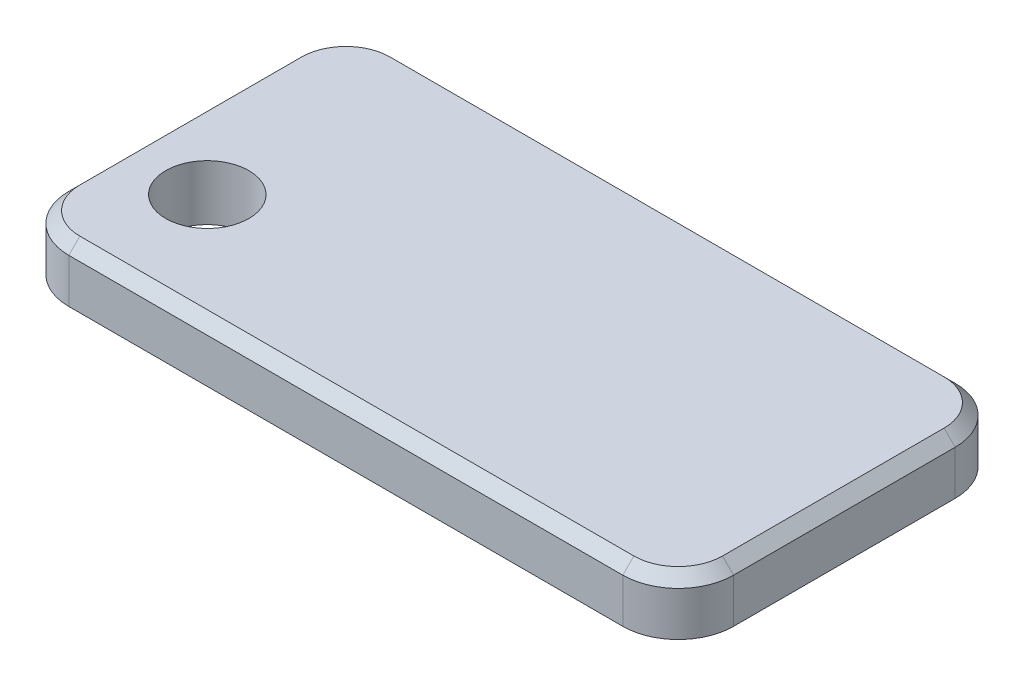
ISO-10303-21;
HEADER;
FILE_DESCRIPTION(('STEP AP214'),'2;1');
FILE_NAME('part.step','',(''),(''),'','','');
FILE_SCHEMA(('AUTOMOTIVE_DESIGN { 1 0 10303 214 1 1 1 1 }'));
ENDSEC;
DATA;
#1=APPLICATION_CONTEXT('core data for automotive mechanical design processes');
#2=APPLICATION_PROTOCOL_DEFINITION('international standard','automotive_design',2000,#1);
#3=PRODUCT_CONTEXT('',#1,'mechanical');
#4=PRODUCT('Part','Part','',(#3));
#5=PRODUCT_RELATED_PRODUCT_CATEGORY('part','',(#4));
#6=PRODUCT_DEFINITION_FORMATION('','',#4);
#7=PRODUCT_DEFINITION_CONTEXT('part definition',#1,'design');
#8=PRODUCT_DEFINITION('design','',#6,#7);
#9=PRODUCT_DEFINITION_SHAPE('','',#8);
#10=(LENGTH_UNIT() NAMED_UNIT(*) SI_UNIT(.MILLI.,.METRE.));
#11=(NAMED_UNIT(*) PLANE_ANGLE_UNIT() SI_UNIT($,.RADIAN.));
#12=(NAMED_UNIT(*) SI_UNIT($,.STERADIAN.) SOLID_ANGLE_UNIT());
#13=UNCERTAINTY_MEASURE_WITH_UNIT(LENGTH_MEASURE(1.E-05),#10,'distance_accuracy_value','');
#14=(GEOMETRIC_REPRESENTATION_CONTEXT(3) GLOBAL_UNCERTAINTY_ASSIGNED_CONTEXT((#13)) GLOBAL_UNIT_ASSIGNED_CONTEXT((#10,
#11,#12)) REPRESENTATION_CONTEXT('',''));
#15=CARTESIAN_POINT('',(0.,0.,0.));
#16=DIRECTION('',(0.,0.,1.));
#17=DIRECTION('',(1.,0.,0.));
#18=AXIS2_PLACEMENT_3D('',#15,#16,#17);
#19=CARTESIAN_POINT('',(0.,12.7,0.));
#20=DIRECTION('',(1.,0.,0.));
#21=DIRECTION('',(0.,0.,-1.));
#22=AXIS2_PLACEMENT_3D('',#19,#20,#21);
#23=PLANE('',#22);
#24=DIRECTION('',(0.,-1.,0.));
#25=VECTOR('',#24,1.);
#26=CARTESIAN_POINT('',(0.,12.7,-12.7));
#27=LINE('',#26,#25);
#28=CARTESIAN_POINT('',(0.,0.,-12.7));
#29=VERTEX_POINT('',#28);
#30=CARTESIAN_POINT('',(0.,10.16,-12.7));
#31=VERTEX_POINT('',#30);
#32=EDGE_CURVE('E161',#29,#31,#27,.F.);
#33=ORIENTED_EDGE('',*,*,#32,.T.);
#34=DIRECTION('',(0.,0.,-1.));
#35=VECTOR('',#34,1.);
#36=CARTESIAN_POINT('',(0.,10.16,0.));
#37=LINE('',#36,#35);
#38=CARTESIAN_POINT('',(0.,10.16,-63.5));
#39=VERTEX_POINT('',#38);
#40=EDGE_CURVE('E186',#31,#39,#37,.T.);
#41=ORIENTED_EDGE('',*,*,#40,.T.);
#42=DIRECTION('',(0.,-1.,0.));
#43=VECTOR('',#42,1.);
#44=CARTESIAN_POINT('',(0.,12.7,-63.5));
#45=LINE('',#44,#43);
#46=CARTESIAN_POINT('',(0.,0.,-63.5));
#47=VERTEX_POINT('',#46);
#48=EDGE_CURVE('E159',#39,#47,#45,.T.);
#49=ORIENTED_EDGE('',*,*,#48,.T.);
#50=DIRECTION('',(0.,0.,1.));
#51=VECTOR('',#50,1.);
#52=CARTESIAN_POINT('',(0.,0.,0.));
#53=LINE('',#52,#51);
#54=EDGE_CURVE('E204',#47,#29,#53,.T.);
#55=ORIENTED_EDGE('',*,*,#54,.T.);
#56=EDGE_LOOP('',(#33,#41,#49,#55));
#57=FACE_BOUND('',#56,.T.);
#58=ADVANCED_FACE('F27',(#57),#23,.F.);
#59=CARTESIAN_POINT('',(0.,12.7,0.));
#60=DIRECTION('',(0.,0.,-1.));
#61=DIRECTION('',(-1.,0.,0.));
#62=AXIS2_PLACEMENT_3D('',#59,#60,#61);
#63=PLANE('',#62);
#64=DIRECTION('',(0.,-1.,0.));
#65=VECTOR('',#64,1.);
#66=CARTESIAN_POINT('',(139.7,12.7,0.));
#67=LINE('',#66,#65);
#68=CARTESIAN_POINT('',(139.7,0.,0.));
#69=VERTEX_POINT('',#68);
#70=CARTESIAN_POINT('',(139.7,10.16,0.));
#71=VERTEX_POINT('',#70);
#72=EDGE_CURVE('E157',#69,#71,#67,.F.);
#73=ORIENTED_EDGE('',*,*,#72,.T.);
#74=DIRECTION('',(-1.,0.,0.));
#75=VECTOR('',#74,1.);
#76=CARTESIAN_POINT('',(0.,10.16,0.));
#77=LINE('',#76,#75);
#78=CARTESIAN_POINT('',(12.7,10.16,0.));
#79=VERTEX_POINT('',#78);
#80=EDGE_CURVE('E11',#71,#79,#77,.T.);
#81=ORIENTED_EDGE('',*,*,#80,.T.);
#82=DIRECTION('',(0.,-1.,0.));
#83=VECTOR('',#82,1.);
#84=CARTESIAN_POINT('',(12.7,12.7,0.));
#85=LINE('',#84,#83);
#86=CARTESIAN_POINT('',(12.7,0.,0.));
#87=VERTEX_POINT('',#86);
#88=EDGE_CURVE('E155',#79,#87,#85,.T.);
#89=ORIENTED_EDGE('',*,*,#88,.T.);
#90=DIRECTION('',(1.,0.,0.));
#91=VECTOR('',#90,1.);
#92=CARTESIAN_POINT('',(0.,0.,0.));
#93=LINE('',#92,#91);
#94=EDGE_CURVE('E145',#87,#69,#93,.T.);
#95=ORIENTED_EDGE('',*,*,#94,.T.);
#96=EDGE_LOOP('',(#73,#81,#89,#95));
#97=FACE_BOUND('',#96,.T.);
#98=ADVANCED_FACE('F265',(#97),#63,.F.);
#99=CARTESIAN_POINT('',(152.4,12.7,0.));
#100=DIRECTION('',(-1.,0.,0.));
#101=DIRECTION('',(0.,0.,1.));
#102=AXIS2_PLACEMENT_3D('',#99,#100,#101);
#103=PLANE('',#102);
#104=DIRECTION('',(0.,-1.,0.));
#105=VECTOR('',#104,1.);
#106=CARTESIAN_POINT('',(152.4,12.7,-63.5));
#107=LINE('',#106,#105);
#108=CARTESIAN_POINT('',(152.4,0.,-63.5));
#109=VERTEX_POINT('',#108);
#110=CARTESIAN_POINT('',(152.4,10.16,-63.5));
#111=VERTEX_POINT('',#110);
#112=EDGE_CURVE('E132',#109,#111,#107,.F.);
#113=ORIENTED_EDGE('',*,*,#112,.T.);
#114=DIRECTION('',(0.,0.,1.));
#115=VECTOR('',#114,1.);
#116=CARTESIAN_POINT('',(152.4,10.16,0.));
#117=LINE('',#116,#115);
#118=CARTESIAN_POINT('',(152.4,10.16,-12.7));
#119=VERTEX_POINT('',#118);
#120=EDGE_CURVE('E188',#111,#119,#117,.T.);
#121=ORIENTED_EDGE('',*,*,#120,.T.);
#122=DIRECTION('',(0.,-1.,0.));
#123=VECTOR('',#122,1.);
#124=CARTESIAN_POINT('',(152.4,12.7,-12.7));
#125=LINE('',#124,#123);
#126=CARTESIAN_POINT('',(152.4,0.,-12.7));
#127=VERTEX_POINT('',#126);
#128=EDGE_CURVE('E136',#119,#127,#125,.T.);
#129=ORIENTED_EDGE('',*,*,#128,.T.);
#130=DIRECTION('',(0.,0.,-1.));
#131=VECTOR('',#130,1.);
#132=CARTESIAN_POINT('',(152.4,0.,0.));
#133=LINE('',#132,#131);
#134=EDGE_CURVE('E142',#127,#109,#133,.T.);
#135=ORIENTED_EDGE('',*,*,#134,.T.);
#136=EDGE_LOOP('',(#113,#121,#129,#135));
#137=FACE_BOUND('',#136,.T.);
#138=ADVANCED_FACE('F241',(#137),#103,.F.);
#139=CARTESIAN_POINT('',(0.,12.7,-76.2));
#140=DIRECTION('',(0.,0.,1.));
#141=DIRECTION('',(1.,0.,0.));
#142=AXIS2_PLACEMENT_3D('',#139,#140,#141);
#143=PLANE('',#142);
#144=DIRECTION('',(0.,-1.,0.));
#145=VECTOR('',#144,1.);
#146=CARTESIAN_POINT('',(12.7,12.7,-76.2));
#147=LINE('',#146,#145);
#148=CARTESIAN_POINT('',(12.7,0.,-76.2));
#149=VERTEX_POINT('',#148);
#150=CARTESIAN_POINT('',(12.7,10.16,-76.2));
#151=VERTEX_POINT('',#150);
#152=EDGE_CURVE('E126',#149,#151,#147,.F.);
#153=ORIENTED_EDGE('',*,*,#152,.T.);
#154=DIRECTION('',(1.,0.,0.));
#155=VECTOR('',#154,1.);
#156=CARTESIAN_POINT('',(0.,10.16,-76.2));
#157=LINE('',#156,#155);
#158=CARTESIAN_POINT('',(139.7,10.16,-76.2));
#159=VERTEX_POINT('',#158);
#160=EDGE_CURVE('E123',#151,#159,#157,.T.);
#161=ORIENTED_EDGE('',*,*,#160,.T.);
#162=DIRECTION('',(0.,-1.,0.));
#163=VECTOR('',#162,1.);
#164=CARTESIAN_POINT('',(139.7,12.7,-76.2));
#165=LINE('',#164,#163);
#166=CARTESIAN_POINT('',(139.7,0.,-76.2));
#167=VERTEX_POINT('',#166);
#168=EDGE_CURVE('E115',#159,#167,#165,.T.);
#169=ORIENTED_EDGE('',*,*,#168,.T.);
#170=DIRECTION('',(-1.,0.,0.));
#171=VECTOR('',#170,1.);
#172=CARTESIAN_POINT('',(0.,0.,-76.2));
#173=LINE('',#172,#171);
#174=EDGE_CURVE('E120',#167,#149,#173,.T.);
#175=ORIENTED_EDGE('',*,*,#174,.T.);
#176=EDGE_LOOP('',(#153,#161,#169,#175));
#177=FACE_BOUND('',#176,.T.);
#178=ADVANCED_FACE('F118',(#177),#143,.F.);
#179=CARTESIAN_POINT('',(0.,12.7,-76.2));
#180=DIRECTION('',(0.,-1.,0.));
#181=DIRECTION('',(0.,0.,-1.));
#182=AXIS2_PLACEMENT_3D('',#179,#180,#181);
#183=PLANE('',#182);
#184=CARTESIAN_POINT('',(139.7,12.7,-63.5));
#185=DIRECTION('',(0.,-1.,0.));
#186=DIRECTION('',(0.,0.,-1.));
#187=AXIS2_PLACEMENT_3D('',#184,#185,#186);
#188=CIRCLE('',#187,10.16);
#189=CARTESIAN_POINT('',(149.86,12.7,-63.5));
#190=VERTEX_POINT('',#189);
#191=CARTESIAN_POINT('',(139.7,12.7,-73.66));
#192=VERTEX_POINT('',#191);
#193=EDGE_CURVE('E174',#190,#192,#188,.F.);
#194=ORIENTED_EDGE('',*,*,#193,.T.);
#195=DIRECTION('',(-1.,0.,0.));
#196=VECTOR('',#195,1.);
#197=CARTESIAN_POINT('',(0.,12.7,-73.66));
#198=LINE('',#197,#196);
#199=CARTESIAN_POINT('',(12.7,12.7,-73.66));
#200=VERTEX_POINT('',#199);
#201=EDGE_CURVE('E178',#192,#200,#198,.T.);
#202=ORIENTED_EDGE('',*,*,#201,.T.);
#203=CARTESIAN_POINT('',(12.7,12.7,-63.5));
#204=DIRECTION('',(0.,-1.,0.));
#205=DIRECTION('',(0.,0.,-1.));
#206=AXIS2_PLACEMENT_3D('',#203,#204,#205);
#207=CIRCLE('',#206,10.16);
#208=CARTESIAN_POINT('',(2.54000000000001,12.7,-63.5));
#209=VERTEX_POINT('',#208);
#210=EDGE_CURVE('E176',#200,#209,#207,.F.);
#211=ORIENTED_EDGE('',*,*,#210,.T.);
#212=DIRECTION('',(0.,0.,1.));
#213=VECTOR('',#212,1.);
#214=CARTESIAN_POINT('',(2.54000000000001,12.7,-76.2));
#215=LINE('',#214,#213);
#216=CARTESIAN_POINT('',(2.54000000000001,12.7,-12.7));
#217=VERTEX_POINT('',#216);
#218=EDGE_CURVE('E172',#209,#217,#215,.T.);
#219=ORIENTED_EDGE('',*,*,#218,.T.);
#220=CARTESIAN_POINT('',(12.7,12.7,-12.7));
#221=DIRECTION('',(0.,-1.,0.));
#222=DIRECTION('',(0.,0.,-1.));
#223=AXIS2_PLACEMENT_3D('',#220,#221,#222);
#224=CIRCLE('',#223,10.16);
#225=CARTESIAN_POINT('',(12.7,12.7,-2.54000000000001));
#226=VERTEX_POINT('',#225);
#227=EDGE_CURVE('E168',#217,#226,#224,.F.);
#228=ORIENTED_EDGE('',*,*,#227,.T.);
#229=DIRECTION('',(1.,0.,0.));
#230=VECTOR('',#229,1.);
#231=CARTESIAN_POINT('',(0.,12.7,-2.54000000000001));
#232=LINE('',#231,#230);
#233=CARTESIAN_POINT('',(139.7,12.7,-2.54000000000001));
#234=VERTEX_POINT('',#233);
#235=EDGE_CURVE('E164',#226,#234,#232,.T.);
#236=ORIENTED_EDGE('',*,*,#235,.T.);
#237=CARTESIAN_POINT('',(139.7,12.7,-12.7));
#238=DIRECTION('',(0.,-1.,0.));
#239=DIRECTION('',(0.,0.,-1.));
#240=AXIS2_PLACEMENT_3D('',#237,#238,#239);
#241=CIRCLE('',#240,10.16);
#242=CARTESIAN_POINT('',(149.86,12.7,-12.7));
#243=VERTEX_POINT('',#242);
#244=EDGE_CURVE('E166',#234,#243,#241,.F.);
#245=ORIENTED_EDGE('',*,*,#244,.T.);
#246=DIRECTION('',(0.,0.,-1.));
#247=VECTOR('',#246,1.);
#248=CARTESIAN_POINT('',(149.86,12.7,-76.2));
#249=LINE('',#248,#247);
#250=EDGE_CURVE('E170',#243,#190,#249,.T.);
#251=ORIENTED_EDGE('',*,*,#250,.T.);
#252=EDGE_LOOP('',(#194,#202,#211,#219,#228,#236,#245,#251));
#253=FACE_BOUND('',#252,.T.);
#254=CARTESIAN_POINT('',(19.05,12.7,-25.4));
#255=DIRECTION('',(0.,1.,0.));
#256=DIRECTION('',(0.,0.,1.));
#257=AXIS2_PLACEMENT_3D('',#254,#255,#256);
#258=CIRCLE('',#257,9.525);
#259=CARTESIAN_POINT('',(19.05,12.7,-15.875));
#260=VERTEX_POINT('',#259);
#261=EDGE_CURVE('E257',#260,#260,#258,.T.);
#262=ORIENTED_EDGE('',*,*,#261,.F.);
#263=EDGE_LOOP('',(#262));
#264=FACE_BOUND('',#263,.T.);
#265=ADVANCED_FACE('F274',(#253,#264),#183,.F.);
#266=CARTESIAN_POINT('',(0.,0.,-76.2));
#267=DIRECTION('',(0.,-1.,0.));
#268=DIRECTION('',(0.,0.,-1.));
#269=AXIS2_PLACEMENT_3D('',#266,#267,#268);
#270=PLANE('',#269);
#271=CARTESIAN_POINT('',(19.05,0.,-25.4));
#272=DIRECTION('',(0.,1.,0.));
#273=DIRECTION('',(0.,0.,1.));
#274=AXIS2_PLACEMENT_3D('',#271,#272,#273);
#275=CIRCLE('',#274,9.525);
#276=CARTESIAN_POINT('',(19.05,0.,-15.875));
#277=VERTEX_POINT('',#276);
#278=EDGE_CURVE('E260',#277,#277,#275,.T.);
#279=ORIENTED_EDGE('',*,*,#278,.T.);
#280=EDGE_LOOP('',(#279));
#281=FACE_BOUND('',#280,.T.);
#282=ORIENTED_EDGE('',*,*,#174,.F.);
#283=CARTESIAN_POINT('',(139.7,0.,-63.5));
#284=DIRECTION('',(0.,-1.,0.));
#285=DIRECTION('',(0.,0.,-1.));
#286=AXIS2_PLACEMENT_3D('',#283,#284,#285);
#287=CIRCLE('',#286,12.7);
#288=EDGE_CURVE('E129',#167,#109,#287,.T.);
#289=ORIENTED_EDGE('',*,*,#288,.T.);
#290=ORIENTED_EDGE('',*,*,#134,.F.);
#291=CARTESIAN_POINT('',(139.7,0.,-12.7));
#292=DIRECTION('',(0.,-1.,0.));
#293=DIRECTION('',(0.,0.,-1.));
#294=AXIS2_PLACEMENT_3D('',#291,#292,#293);
#295=CIRCLE('',#294,12.7);
#296=EDGE_CURVE('E137',#127,#69,#295,.T.);
#297=ORIENTED_EDGE('',*,*,#296,.T.);
#298=ORIENTED_EDGE('',*,*,#94,.F.);
#299=CARTESIAN_POINT('',(12.7,0.,-12.7));
#300=DIRECTION('',(0.,-1.,0.));
#301=DIRECTION('',(0.,0.,-1.));
#302=AXIS2_PLACEMENT_3D('',#299,#300,#301);
#303=CIRCLE('',#302,12.7);
#304=EDGE_CURVE('E150',#87,#29,#303,.T.);
#305=ORIENTED_EDGE('',*,*,#304,.T.);
#306=ORIENTED_EDGE('',*,*,#54,.F.);
#307=CARTESIAN_POINT('',(12.7,0.,-63.5));
#308=DIRECTION('',(0.,-1.,0.));
#309=DIRECTION('',(0.,0.,-1.));
#310=AXIS2_PLACEMENT_3D('',#307,#308,#309);
#311=CIRCLE('',#310,12.7);
#312=EDGE_CURVE('E125',#47,#149,#311,.T.);
#313=ORIENTED_EDGE('',*,*,#312,.T.);
#314=EDGE_LOOP('',(#282,#289,#290,#297,#298,#305,#306,#313));
#315=FACE_BOUND('',#314,.T.);
#316=ADVANCED_FACE('F139',(#281,#315),#270,.T.);
#317=CARTESIAN_POINT('',(19.05,0.,-25.4));
#318=DIRECTION('',(0.,1.,0.));
#319=DIRECTION('',(0.,0.,1.));
#320=AXIS2_PLACEMENT_3D('',#317,#318,#319);
#321=CYLINDRICAL_SURFACE('',#320,9.525);
#322=ORIENTED_EDGE('',*,*,#278,.F.);
#323=EDGE_LOOP('',(#322));
#324=FACE_BOUND('',#323,.T.);
#325=ORIENTED_EDGE('',*,*,#261,.T.);
#326=EDGE_LOOP('',(#325));
#327=FACE_BOUND('',#326,.T.);
#328=ADVANCED_FACE('F280',(#324,#327),#321,.F.);
#329=CARTESIAN_POINT('',(139.7,12.7,-63.5));
#330=DIRECTION('',(0.,-1.,0.));
#331=DIRECTION('',(0.,0.,-1.));
#332=AXIS2_PLACEMENT_3D('',#329,#330,#331);
#333=CYLINDRICAL_SURFACE('',#332,12.7);
#334=ORIENTED_EDGE('',*,*,#168,.F.);
#335=CARTESIAN_POINT('',(139.7,10.16,-63.5));
#336=DIRECTION('',(0.,-1.,0.));
#337=DIRECTION('',(0.,0.,-1.));
#338=AXIS2_PLACEMENT_3D('',#335,#336,#337);
#339=CIRCLE('',#338,12.7);
#340=EDGE_CURVE('E184',#159,#111,#339,.T.);
#341=ORIENTED_EDGE('',*,*,#340,.T.);
#342=ORIENTED_EDGE('',*,*,#112,.F.);
#343=ORIENTED_EDGE('',*,*,#288,.F.);
#344=EDGE_LOOP('',(#334,#341,#342,#343));
#345=FACE_BOUND('',#344,.T.);
#346=ADVANCED_FACE('F130',(#345),#333,.T.);
#347=CARTESIAN_POINT('',(139.7,12.7,-12.7));
#348=DIRECTION('',(0.,-1.,0.));
#349=DIRECTION('',(0.,0.,-1.));
#350=AXIS2_PLACEMENT_3D('',#347,#348,#349);
#351=CYLINDRICAL_SURFACE('',#350,12.7);
#352=ORIENTED_EDGE('',*,*,#128,.F.);
#353=CARTESIAN_POINT('',(139.7,10.16,-12.7));
#354=DIRECTION('',(0.,-1.,0.));
#355=DIRECTION('',(0.,0.,-1.));
#356=AXIS2_PLACEMENT_3D('',#353,#354,#355);
#357=CIRCLE('',#356,12.7);
#358=EDGE_CURVE('E34',#119,#71,#357,.T.);
#359=ORIENTED_EDGE('',*,*,#358,.T.);
#360=ORIENTED_EDGE('',*,*,#72,.F.);
#361=ORIENTED_EDGE('',*,*,#296,.F.);
#362=EDGE_LOOP('',(#352,#359,#360,#361));
#363=FACE_BOUND('',#362,.T.);
#364=ADVANCED_FACE('F267',(#363),#351,.T.);
#365=CARTESIAN_POINT('',(12.7,12.7,-12.7));
#366=DIRECTION('',(0.,-1.,0.));
#367=DIRECTION('',(0.,0.,-1.));
#368=AXIS2_PLACEMENT_3D('',#365,#366,#367);
#369=CYLINDRICAL_SURFACE('',#368,12.7);
#370=ORIENTED_EDGE('',*,*,#88,.F.);
#371=CARTESIAN_POINT('',(12.7,10.16,-12.7));
#372=DIRECTION('',(0.,-1.,0.));
#373=DIRECTION('',(0.,0.,-1.));
#374=AXIS2_PLACEMENT_3D('',#371,#372,#373);
#375=CIRCLE('',#374,12.7);
#376=EDGE_CURVE('E190',#79,#31,#375,.T.);
#377=ORIENTED_EDGE('',*,*,#376,.T.);
#378=ORIENTED_EDGE('',*,*,#32,.F.);
#379=ORIENTED_EDGE('',*,*,#304,.F.);
#380=EDGE_LOOP('',(#370,#377,#378,#379));
#381=FACE_BOUND('',#380,.T.);
#382=ADVANCED_FACE('F194',(#381),#369,.T.);
#383=CARTESIAN_POINT('',(12.7,12.7,-63.5));
#384=DIRECTION('',(0.,-1.,0.));
#385=DIRECTION('',(0.,0.,-1.));
#386=AXIS2_PLACEMENT_3D('',#383,#384,#385);
#387=CYLINDRICAL_SURFACE('',#386,12.7);
#388=ORIENTED_EDGE('',*,*,#48,.F.);
#389=CARTESIAN_POINT('',(12.7,10.16,-63.5));
#390=DIRECTION('',(0.,-1.,0.));
#391=DIRECTION('',(0.,0.,-1.));
#392=AXIS2_PLACEMENT_3D('',#389,#390,#391);
#393=CIRCLE('',#392,12.7);
#394=EDGE_CURVE('E182',#39,#151,#393,.T.);
#395=ORIENTED_EDGE('',*,*,#394,.T.);
#396=ORIENTED_EDGE('',*,*,#152,.F.);
#397=ORIENTED_EDGE('',*,*,#312,.F.);
#398=EDGE_LOOP('',(#388,#395,#396,#397));
#399=FACE_BOUND('',#398,.T.);
#400=ADVANCED_FACE('F227',(#399),#387,.T.);
#401=CARTESIAN_POINT('',(0.,12.7,-2.54000000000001));
#402=DIRECTION('',(0.,-0.707106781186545,-0.707106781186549));
#403=DIRECTION('',(0.,0.707106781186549,-0.707106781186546));
#404=AXIS2_PLACEMENT_3D('',#401,#402,#403);
#405=PLANE('',#404);
#406=DIRECTION('',(0.,0.707106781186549,-0.707106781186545));
#407=VECTOR('',#406,1.);
#408=CARTESIAN_POINT('',(12.7,10.16,0.));
#409=LINE('',#408,#407);
#410=EDGE_CURVE('E249',#79,#226,#409,.T.);
#411=ORIENTED_EDGE('',*,*,#410,.F.);
#412=ORIENTED_EDGE('',*,*,#80,.F.);
#413=DIRECTION('',(0.,-0.707106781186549,0.707106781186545));
#414=VECTOR('',#413,1.);
#415=CARTESIAN_POINT('',(139.7,12.7,-2.54000000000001));
#416=LINE('',#415,#414);
#417=EDGE_CURVE('E251',#234,#71,#416,.T.);
#418=ORIENTED_EDGE('',*,*,#417,.F.);
#419=ORIENTED_EDGE('',*,*,#235,.F.);
#420=EDGE_LOOP('',(#411,#412,#418,#419));
#421=FACE_BOUND('',#420,.T.);
#422=ADVANCED_FACE('F272',(#421),#405,.F.);
#423=CARTESIAN_POINT('',(139.7,12.7,-12.7));
#424=DIRECTION('',(0.,-1.,0.));
#425=DIRECTION('',(0.,0.,-1.));
#426=AXIS2_PLACEMENT_3D('',#423,#424,#425);
#427=CONICAL_SURFACE('',#426,10.16,0.785398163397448);
#428=ORIENTED_EDGE('',*,*,#417,.T.);
#429=ORIENTED_EDGE('',*,*,#358,.F.);
#430=DIRECTION('',(0.707106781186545,-0.707106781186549,0.));
#431=VECTOR('',#430,1.);
#432=CARTESIAN_POINT('',(149.86,12.7,-12.7));
#433=LINE('',#432,#431);
#434=EDGE_CURVE('E211',#243,#119,#433,.T.);
#435=ORIENTED_EDGE('',*,*,#434,.F.);
#436=ORIENTED_EDGE('',*,*,#244,.F.);
#437=EDGE_LOOP('',(#428,#429,#435,#436));
#438=FACE_BOUND('',#437,.T.);
#439=ADVANCED_FACE('F268',(#438),#427,.T.);
#440=CARTESIAN_POINT('',(12.7,12.7,-12.7));
#441=DIRECTION('',(0.,-1.,0.));
#442=DIRECTION('',(0.,0.,-1.));
#443=AXIS2_PLACEMENT_3D('',#440,#441,#442);
#444=CONICAL_SURFACE('',#443,10.16,0.785398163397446);
#445=ORIENTED_EDGE('',*,*,#410,.T.);
#446=ORIENTED_EDGE('',*,*,#227,.F.);
#447=DIRECTION('',(0.707106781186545,0.707106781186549,0.));
#448=VECTOR('',#447,1.);
#449=CARTESIAN_POINT('',(0.,10.16,-12.7));
#450=LINE('',#449,#448);
#451=EDGE_CURVE('E207',#31,#217,#450,.T.);
#452=ORIENTED_EDGE('',*,*,#451,.F.);
#453=ORIENTED_EDGE('',*,*,#376,.F.);
#454=EDGE_LOOP('',(#445,#446,#452,#453));
#455=FACE_BOUND('',#454,.T.);
#456=ADVANCED_FACE('F208',(#455),#444,.T.);
#457=CARTESIAN_POINT('',(149.86,12.7,-76.2));
#458=DIRECTION('',(-0.707106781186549,-0.707106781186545,0.));
#459=DIRECTION('',(0.707106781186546,-0.707106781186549,0.));
#460=AXIS2_PLACEMENT_3D('',#457,#458,#459);
#461=PLANE('',#460);
#462=ORIENTED_EDGE('',*,*,#434,.T.);
#463=ORIENTED_EDGE('',*,*,#120,.F.);
#464=DIRECTION('',(0.707106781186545,-0.707106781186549,0.));
#465=VECTOR('',#464,1.);
#466=CARTESIAN_POINT('',(149.86,12.7,-63.5));
#467=LINE('',#466,#465);
#468=EDGE_CURVE('E212',#190,#111,#467,.T.);
#469=ORIENTED_EDGE('',*,*,#468,.F.);
#470=ORIENTED_EDGE('',*,*,#250,.F.);
#471=EDGE_LOOP('',(#462,#463,#469,#470));
#472=FACE_BOUND('',#471,.T.);
#473=ADVANCED_FACE('F244',(#472),#461,.F.);
#474=CARTESIAN_POINT('',(2.54000000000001,12.7,-76.2));
#475=DIRECTION('',(0.707106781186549,-0.707106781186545,0.));
#476=DIRECTION('',(0.707106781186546,0.707106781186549,0.));
#477=AXIS2_PLACEMENT_3D('',#474,#475,#476);
#478=PLANE('',#477);
#479=ORIENTED_EDGE('',*,*,#451,.T.);
#480=ORIENTED_EDGE('',*,*,#218,.F.);
#481=DIRECTION('',(0.707106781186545,0.707106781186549,0.));
#482=VECTOR('',#481,1.);
#483=CARTESIAN_POINT('',(0.,10.16,-63.5));
#484=LINE('',#483,#482);
#485=EDGE_CURVE('E217',#39,#209,#484,.T.);
#486=ORIENTED_EDGE('',*,*,#485,.F.);
#487=ORIENTED_EDGE('',*,*,#40,.F.);
#488=EDGE_LOOP('',(#479,#480,#486,#487));
#489=FACE_BOUND('',#488,.T.);
#490=ADVANCED_FACE('F215',(#489),#478,.F.);
#491=CARTESIAN_POINT('',(139.7,12.7,-63.5));
#492=DIRECTION('',(0.,-1.,0.));
#493=DIRECTION('',(0.,0.,-1.));
#494=AXIS2_PLACEMENT_3D('',#491,#492,#493);
#495=CONICAL_SURFACE('',#494,10.16,0.785398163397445);
#496=ORIENTED_EDGE('',*,*,#468,.T.);
#497=ORIENTED_EDGE('',*,*,#340,.F.);
#498=DIRECTION('',(0.,-0.707106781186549,-0.707106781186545));
#499=VECTOR('',#498,1.);
#500=CARTESIAN_POINT('',(139.7,12.7,-73.66));
#501=LINE('',#500,#499);
#502=EDGE_CURVE('E221',#192,#159,#501,.T.);
#503=ORIENTED_EDGE('',*,*,#502,.F.);
#504=ORIENTED_EDGE('',*,*,#193,.F.);
#505=EDGE_LOOP('',(#496,#497,#503,#504));
#506=FACE_BOUND('',#505,.T.);
#507=ADVANCED_FACE('F237',(#506),#495,.T.);
#508=CARTESIAN_POINT('',(12.7,12.7,-63.5));
#509=DIRECTION('',(0.,-1.,0.));
#510=DIRECTION('',(0.,0.,-1.));
#511=AXIS2_PLACEMENT_3D('',#508,#509,#510);
#512=CONICAL_SURFACE('',#511,10.16,0.785398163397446);
#513=ORIENTED_EDGE('',*,*,#485,.T.);
#514=ORIENTED_EDGE('',*,*,#210,.F.);
#515=DIRECTION('',(0.,0.707106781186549,0.707106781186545));
#516=VECTOR('',#515,1.);
#517=CARTESIAN_POINT('',(12.7,10.16,-76.2));
#518=LINE('',#517,#516);
#519=EDGE_CURVE('E225',#151,#200,#518,.T.);
#520=ORIENTED_EDGE('',*,*,#519,.F.);
#521=ORIENTED_EDGE('',*,*,#394,.F.);
#522=EDGE_LOOP('',(#513,#514,#520,#521));
#523=FACE_BOUND('',#522,.T.);
#524=ADVANCED_FACE('F224',(#523),#512,.T.);
#525=CARTESIAN_POINT('',(0.,12.7,-73.66));
#526=DIRECTION('',(0.,-0.707106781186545,0.707106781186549));
#527=DIRECTION('',(0.,-0.707106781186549,-0.707106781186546));
#528=AXIS2_PLACEMENT_3D('',#525,#526,#527);
#529=PLANE('',#528);
#530=ORIENTED_EDGE('',*,*,#502,.T.);
#531=ORIENTED_EDGE('',*,*,#160,.F.);
#532=ORIENTED_EDGE('',*,*,#519,.T.);
#533=ORIENTED_EDGE('',*,*,#201,.F.);
#534=EDGE_LOOP('',(#530,#531,#532,#533));
#535=FACE_BOUND('',#534,.T.);
#536=ADVANCED_FACE('F229',(#535),#529,.F.);
#537=CLOSED_SHELL('',(#58,#98,#138,#178,#265,#316,#328,#346,#364,#382,#400,#422,#439,#456,#473,
#490,#507,#524,#536));
#538=MANIFOLD_SOLID_BREP('B2',#537);
#539=ADVANCED_BREP_SHAPE_REPRESENTATION('',(#18,#538),#14);
#540=SHAPE_DEFINITION_REPRESENTATION(#9,#539);
ENDSEC;
END-ISO-10303-21;
